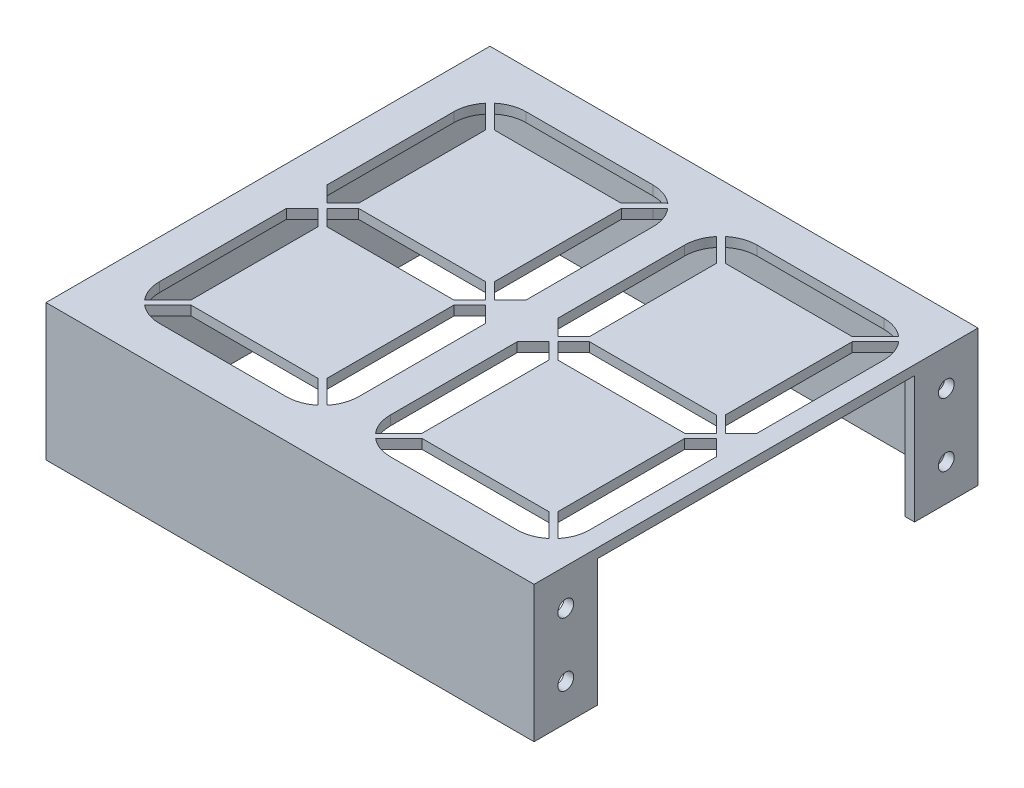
from build123d import *

# Parameters (mm, degrees)
SALIENTE_EXTRUIR4_DEPTH = 3
SALIENTE_EXTRUIR5_DEPTH = 40
CROQUIS4_R              = 2.5
CORTAR_EXTRUIR2_DEPTH   = 3
CROQUIS6_W              = 8
CROQUIS6_H              = 8
SALIENTE_EXTRUIR8_DEPTH = 3
CROQUIS7_R              = 1.25
CROQUIS7_R_2            = 3
CORTAR_EXTRUIR4_DEPTH   = 3
REDONDEO2_R             = 3
CROQUIS8_W              = 6
CROQUIS8_H              = 2
SALIENTE_EXTRUIR9_DEPTH = 6
CORTAR_EXTRUIR5_DEPTH   = 20
CROQUIS10_R             = 3.5
CORTAR_EXTRUIR7_DEPTH   = 3


with BuildPart() as part:
    # Croquis2 → Saliente-Extruir4 (new body)
    with BuildSketch(Plane(origin=(0, 0, 0), x_dir=(1, 0, 0), z_dir=(0, 1, 0))):
        Polygon((-80, 0), (-80, 69.99998238), (73.913458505, 69.99998238), (73.913458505, -69.99998238), (-80, -69.99998238), align=None)
        Polygon((-16.41, 5), (-56.41, 5), (-61.41, 0), (-56.41, -5), (-16.41, -5), (-11.41, 0), align=None, mode=Mode.SUBTRACT)
        with BuildLine():
            Line((-14.995784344, 6.414213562), (-9.995784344, 1.414213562))
            Line((-9.995784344, 1.414213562), (-4.993086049, 6.410002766))
            Line((-4.993086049, 6.410002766), (-4.993086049, 46.403088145))
            ThreePointArc((-4.993086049, 46.403088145), (-5.681536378, 50.307699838), (-7.663858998, 53.741408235))
            Line((-7.663858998, 53.741408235), (-9.995784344, 51.412703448))
            Line((-9.995784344, 51.412703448), (-14.995784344, 46.412703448))
            Line((-14.995784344, 46.412703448), (-14.995784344, 6.414213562))
        make_face(mode=Mode.SUBTRACT)
        with BuildLine():
            Line((-57.824213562, 46.412703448), (-57.824213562, 6.414213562))
            Line((-57.824213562, 6.414213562), (-62.824213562, 1.414213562))
            Line((-62.824213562, 1.414213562), (-67.823458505, 6.413458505))
            Line((-67.823458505, 6.413458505), (-67.823458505, 46.413458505))
            ThreePointArc((-67.823458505, 46.413458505), (-67.135816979, 50.314019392), (-65.155801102, 53.744290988))
            Line((-65.155801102, 53.744290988), (-62.824213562, 51.412703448))
            Line((-62.824213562, 51.412703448), (-57.824213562, 46.412703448))
        make_face(mode=Mode.SUBTRACT)
        with BuildLine():
            Line((-14.99578434, -6.407294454), (-9.99578434, -1.407294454))
            Line((-9.99578434, -1.407294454), (-4.996536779, -6.41345589))
            Line((-4.996536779, -6.41345589), (-4.996515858, -46.406505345))
            ThreePointArc((-4.996515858, -46.406505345), (-5.683843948, -50.307429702), (-7.663049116, -53.738519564))
            Line((-7.663049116, -53.738519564), (-9.99578434, -51.40578434))
            Line((-9.99578434, -51.40578434), (-14.99578434, -46.40578434))
            Line((-14.99578434, -46.40578434), (-14.99578434, -6.407294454))
        make_face(mode=Mode.SUBTRACT)
        with BuildLine():
            Line((-57.817239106, -6.414206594), (-62.817244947, -1.414200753))
            Line((-62.817244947, -1.414200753), (-67.816496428, -6.413452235))
            Line((-67.816496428, -6.413452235), (-67.816485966, -46.413452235))
            ThreePointArc((-67.816485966, -46.413452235), (-67.128843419, -50.314012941), (-65.148826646, -53.74428402))
            Line((-65.148826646, -53.74428402), (-62.817239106, -51.41269648))
            Line((-62.817239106, -51.41269648), (-57.817239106, -46.41269648))
            Line((-57.817239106, -46.41269648), (-57.817239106, -6.414206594))
        make_face(mode=Mode.SUBTRACT)
        with BuildLine():
            Line((-11.409971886, -52.819968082), (-16.409971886, -47.819968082))
            Line((-16.409971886, -47.819968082), (-56.409971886, -47.819968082))
            Line((-56.409971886, -47.819968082), (-61.409971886, -52.819968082))
            Line((-61.409971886, -52.819968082), (-63.741625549, -55.151621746))
            ThreePointArc((-63.741625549, -55.151621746), (-60.311022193, -57.132162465), (-56.409936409, -57.819992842))
            Line((-56.409936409, -57.819992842), (-16.40997049, -57.819971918))
            ThreePointArc((-16.40997049, -57.819971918), (-12.50856319, -57.132463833), (-9.077170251, -55.152769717))
            Line((-9.077170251, -55.152769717), (-11.409971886, -52.819968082))
        make_face(mode=Mode.SUBTRACT)
        with BuildLine():
            Line((-16.416914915, 47.820002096), (-11.416914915, 52.820002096))
            Line((-11.416914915, 52.820002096), (-9.07863101, 55.15505666))
            ThreePointArc((-9.07863101, 55.15505666), (-12.509650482, 57.133102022), (-16.41, 57.820002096))
            Line((-16.41, 57.820002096), (-56.416914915, 57.820002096))
            ThreePointArc((-56.416914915, 57.820002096), (-60.317979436, 57.132177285), (-63.748568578, 55.151655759))
            Line((-63.748568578, 55.151655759), (-61.416914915, 52.820002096))
            Line((-61.416914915, 52.820002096), (-56.416914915, 47.820002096))
            Line((-56.416914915, 47.820002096), (-16.416914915, 47.820002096))
        make_face(mode=Mode.SUBTRACT)
        with BuildLine():
            Line((9.99578434, -1.407294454), (4.996536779, -6.41345589))
            Line((4.996536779, -6.41345589), (4.996515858, -46.406505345))
            ThreePointArc((4.996515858, -46.406505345), (5.683843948, -50.307429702), (7.663049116, -53.738519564))
            Line((7.663049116, -53.738519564), (9.99578434, -51.40578434))
            Line((9.99578434, -51.40578434), (14.99578434, -46.40578434))
            Line((14.99578434, -46.40578434), (14.99578434, -6.407294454))
            Line((14.99578434, -6.407294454), (9.99578434, -1.407294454))
        make_face(mode=Mode.SUBTRACT)
        with BuildLine():
            Line((9.995784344, 1.414213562), (4.993086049, 6.410002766))
            Line((4.993086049, 6.410002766), (4.993086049, 46.403088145))
            ThreePointArc((4.993086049, 46.403088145), (5.681536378, 50.307699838), (7.663858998, 53.741408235))
            Line((7.663858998, 53.741408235), (9.995784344, 51.412703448))
            Line((9.995784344, 51.412703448), (14.995784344, 46.412703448))
            Line((14.995784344, 46.412703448), (14.995784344, 6.414213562))
            Line((14.995784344, 6.414213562), (9.995784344, 1.414213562))
        make_face(mode=Mode.SUBTRACT)
        with BuildLine():
            Line((62.817244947, -1.414200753), (67.816496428, -6.413452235))
            Line((67.816496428, -6.413452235), (67.816485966, -46.413452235))
            ThreePointArc((67.816485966, -46.413452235), (67.128843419, -50.314012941), (65.148826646, -53.74428402))
            Line((65.148826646, -53.74428402), (62.817239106, -51.41269648))
            Line((62.817239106, -51.41269648), (57.817239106, -46.41269648))
            Line((57.817239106, -46.41269648), (57.817239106, -6.414206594))
            Line((57.817239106, -6.414206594), (62.817244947, -1.414200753))
        make_face(mode=Mode.SUBTRACT)
        with BuildLine():
            Line((62.824213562, 1.414213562), (67.823458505, 6.413458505))
            Line((67.823458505, 6.413458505), (67.823458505, 46.413458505))
            ThreePointArc((67.823458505, 46.413458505), (67.135816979, 50.314019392), (65.155801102, 53.744290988))
            Line((65.155801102, 53.744290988), (62.824213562, 51.412703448))
            Line((62.824213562, 51.412703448), (57.824213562, 46.412703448))
            Line((57.824213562, 46.412703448), (57.824213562, 6.414213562))
            Line((57.824213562, 6.414213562), (62.824213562, 1.414213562))
        make_face(mode=Mode.SUBTRACT)
        with BuildLine():
            Line((11.409971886, -52.819968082), (9.077170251, -55.152769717))
            ThreePointArc((9.077170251, -55.152769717), (12.50856319, -57.132463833), (16.40997049, -57.819971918))
            Line((16.40997049, -57.819971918), (56.409936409, -57.819992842))
            ThreePointArc((56.409936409, -57.819992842), (60.311022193, -57.132162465), (63.741625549, -55.151621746))
            Line((63.741625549, -55.151621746), (61.409971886, -52.819968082))
            Line((61.409971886, -52.819968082), (56.409971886, -47.819968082))
            Line((56.409971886, -47.819968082), (16.409971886, -47.819968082))
            Line((16.409971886, -47.819968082), (11.409971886, -52.819968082))
        make_face(mode=Mode.SUBTRACT)
        with BuildLine():
            Line((61.416914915, 52.820002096), (63.748568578, 55.151655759))
            ThreePointArc((63.748568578, 55.151655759), (60.317979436, 57.132177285), (56.416914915, 57.820002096))
            Line((56.416914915, 57.820002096), (16.41, 57.820002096))
            ThreePointArc((16.41, 57.820002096), (12.509650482, 57.133102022), (9.07863101, 55.15505666))
            Line((9.07863101, 55.15505666), (11.416914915, 52.820002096))
            Line((11.416914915, 52.820002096), (16.416914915, 47.820002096))
            Line((16.416914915, 47.820002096), (56.416914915, 47.820002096))
            Line((56.416914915, 47.820002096), (61.416914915, 52.820002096))
        make_face(mode=Mode.SUBTRACT)
        Polygon((61.41, 0), (56.41, -5), (16.41, -5), (11.41, 0), (16.41, 5), (56.41, 5), align=None, mode=Mode.SUBTRACT)
    extrude(amount=SALIENTE_EXTRUIR4_DEPTH)

    # Croquis3 → Saliente-Extruir5 (add)
    with BuildSketch(Plane(origin=(0, 0, 0), x_dir=(-1, 0, 0), z_dir=(0, -1, 0))):
        Polygon((80, -69.99998238), (-73.913458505, -69.99998238), (-73.913458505, -49.99998238), (-70.913458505, -49.99998238), (-70.913458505, -66.99998238), (77, -66.99998238), (77, 66.99998238), (-70.913458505, 66.99998238), (-70.913458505, 49.99998238), (-73.913458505, 49.99998238), (-73.913458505, 69.99998238), (80, 69.99998238), align=None)
    extrude(amount=SALIENTE_EXTRUIR5_DEPTH)

    # Croquis4 → Cortar-Extruir2 (cut)
    with BuildSketch(Plane(origin=(73.913458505, 0, 0), x_dir=(0, 0, -1), z_dir=(1, 0, 0))):
        with Locations((-59.99998238, -8.5)):
            Circle(CROQUIS4_R)
        with Locations((-59.99998238, -28.5)):
            Circle(CROQUIS4_R)
        with Locations((59.99998238, -8.5)):
            Circle(CROQUIS4_R)
        with Locations((59.99998238, -28.5)):
            Circle(CROQUIS4_R)
    extrude(amount=-CORTAR_EXTRUIR2_DEPTH, mode=Mode.SUBTRACT)

    # Croquis6 → Saliente-Extruir8 (add)
    with BuildSketch(Plane.XZ.offset(40)):
        Polygon((-95, -10), (-80, -10), (-80, 0), (-80, 10), (-95, 10), align=None)
        Polygon((-69, -66.99998238), (-77, -58.99998238), (-77, -66.99998238), align=None)
        Polygon((70.913458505, -58.49998238), (62.913458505, -66.99998238), (70.913458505, -66.99998238), align=None)
        with Locations((-73, 0)):
            Rectangle(CROQUIS6_W, CROQUIS6_H)
        Polygon((-69, 66.99998238), (-77, 66.99998238), (-77, 58.99998238), align=None)
        Polygon((-3.043270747, 66.99998238), (-7.043270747, 66.99998238), (-7.043270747, 58.99998238), (0.956729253, 58.99998238), (0.956729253, 66.99998238), align=None)
        Polygon((70.913458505, 66.99998238), (62.913458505, 66.99998238), (70.913458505, 58.99998238), align=None)
        with Locations((-3.043270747, -62.99998238)):
            Rectangle(CROQUIS6_W, CROQUIS6_H)
    extrude(amount=-SALIENTE_EXTRUIR8_DEPTH)

    # Croquis7 → Cortar-Extruir4 (cut)
    with BuildSketch(Plane.XZ.offset(40)):
        with Locations(Location((-3.043270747, -62.99998238, 0), (0, 0, 270))):
            Circle(CROQUIS7_R)
        with Locations(Location((-75, -64.99998238, 0), (0, 0, 270))):
            Circle(CROQUIS7_R)
        with Locations(Location((-73, 0, 0), (0, 0, 270))):
            Circle(CROQUIS7_R)
        with Locations(Location((-75, 64.99998238, 0), (0, 0, 270))):
            Circle(CROQUIS7_R)
        with Locations(Location((69.400847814, 64.99998238, 0), (0, 0, 270))):
            Circle(CROQUIS7_R)
        with Locations(Location((69.400847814, -65.091054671, 0), (0, 0, 270))):
            Circle(CROQUIS7_R)
        with Locations(Location((-87.5, 0, 0), (0, 0, 270))):
            Circle(CROQUIS7_R_2)
        with Locations(Location((-3.043270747, 62.99998238, 0), (0, 0, 270))):
            Circle(CROQUIS7_R)
        with BuildLine():
            Line((-95, -2.5), (-95, -10))
            Line((-95, -10), (-87.5, -10))
            ThreePointArc((-87.5, -10), (-92.803300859, -7.803300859), (-95, -2.5))
        make_face()
        with BuildLine():
            Line((-95, 2.5), (-95, 10))
            Line((-95, 10), (-87.5, 10))
            ThreePointArc((-87.5, 10), (-92.803300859, 7.803300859), (-95, 2.5))
        make_face()
    extrude(amount=-CORTAR_EXTRUIR4_DEPTH, mode=Mode.SUBTRACT)

    # Redondeo2
    redondeo2_edges = [part.edges().sort_by_distance(p)[0] for p in [
        (-69, -38.5, -4),
        (-69, -38.5, 4),
        (0.956729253, -38.5, 58.99998238),
        (-7.043270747, -38.5, 58.99998238),
        (-7.043270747, -38.5, -58.99998238),
        (0.956729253, -38.5, -58.99998238),
    ]]
    fillet(redondeo2_edges, radius=REDONDEO2_R)

    # Croquis8 → Saliente-Extruir9 (add)
    with BuildSketch(Plane(origin=(0, -37, 0), x_dir=(1, 0, 0), z_dir=(0, 1, 0))):
        with Locations((-83, 9)):
            Rectangle(CROQUIS8_W, CROQUIS8_H)
        with Locations((-83, -9)):
            Rectangle(CROQUIS8_W, CROQUIS8_H)
    extrude(amount=SALIENTE_EXTRUIR9_DEPTH)

    # Croquis9 → Cortar-Extruir5 (cut)
    with BuildSketch(Plane.XY.offset(10)):
        Polygon((-86, -37), (-80, -31), (-86, -31), align=None)
    extrude(amount=-CORTAR_EXTRUIR5_DEPTH, mode=Mode.SUBTRACT)

    # Croquis10 → Cortar-Extruir7 (cut)
    with BuildSketch(Plane.ZY.offset(80)):
        with Locations((-61.99998238, -32)):
            Circle(CROQUIS10_R)
    extrude(amount=-CORTAR_EXTRUIR7_DEPTH, mode=Mode.SUBTRACT)


solid = part.part
